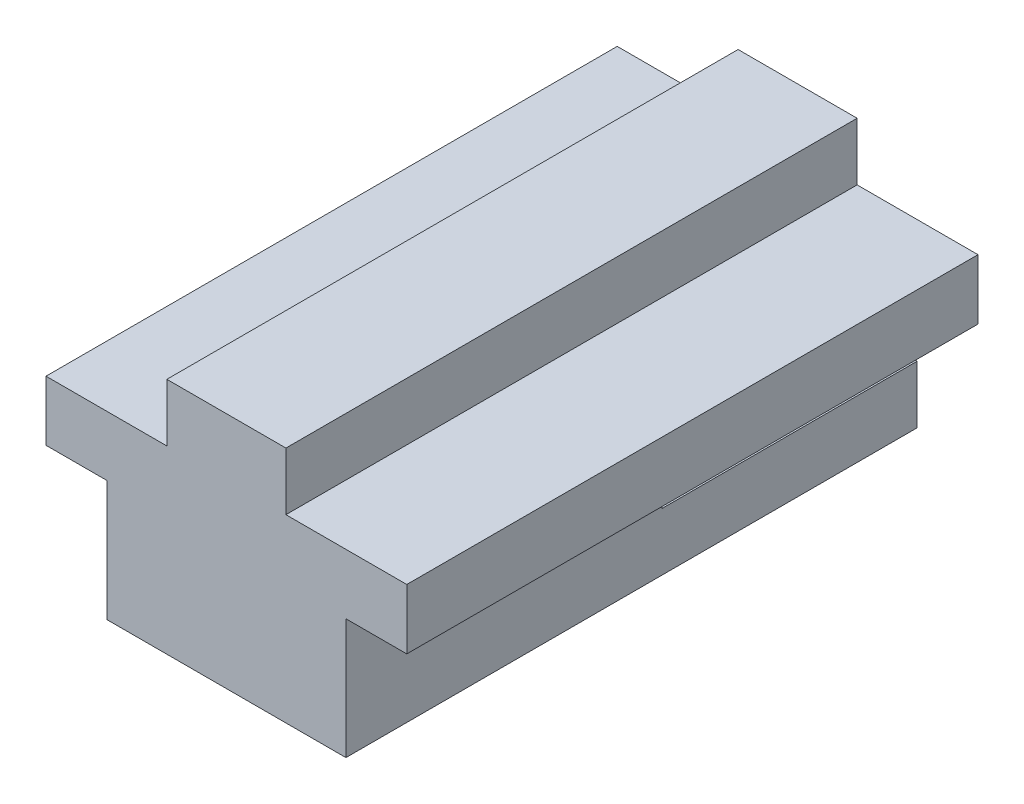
ISO-10303-21;
HEADER;
FILE_DESCRIPTION(('STEP AP214'),'2;1');
FILE_NAME('part.step','',(''),(''),'','','');
FILE_SCHEMA(('AUTOMOTIVE_DESIGN { 1 0 10303 214 1 1 1 1 }'));
ENDSEC;
DATA;
#1=APPLICATION_CONTEXT('core data for automotive mechanical design processes');
#2=APPLICATION_PROTOCOL_DEFINITION('international standard','automotive_design',2000,#1);
#3=PRODUCT_CONTEXT('',#1,'mechanical');
#4=PRODUCT('Part','Part','',(#3));
#5=PRODUCT_RELATED_PRODUCT_CATEGORY('part','',(#4));
#6=PRODUCT_DEFINITION_FORMATION('','',#4);
#7=PRODUCT_DEFINITION_CONTEXT('part definition',#1,'design');
#8=PRODUCT_DEFINITION('design','',#6,#7);
#9=PRODUCT_DEFINITION_SHAPE('','',#8);
#10=(LENGTH_UNIT() NAMED_UNIT(*) SI_UNIT(.MILLI.,.METRE.));
#11=(NAMED_UNIT(*) PLANE_ANGLE_UNIT() SI_UNIT($,.RADIAN.));
#12=(NAMED_UNIT(*) SI_UNIT($,.STERADIAN.) SOLID_ANGLE_UNIT());
#13=UNCERTAINTY_MEASURE_WITH_UNIT(LENGTH_MEASURE(1.E-05),#10,'distance_accuracy_value','');
#14=(GEOMETRIC_REPRESENTATION_CONTEXT(3) GLOBAL_UNCERTAINTY_ASSIGNED_CONTEXT((#13)) GLOBAL_UNIT_ASSIGNED_CONTEXT((#10,
#11,#12)) REPRESENTATION_CONTEXT('',''));
#15=CARTESIAN_POINT('',(0.,0.,0.));
#16=DIRECTION('',(0.,0.,1.));
#17=DIRECTION('',(1.,0.,0.));
#18=AXIS2_PLACEMENT_3D('',#15,#16,#17);
#19=CARTESIAN_POINT('',(0.,0.,-60.325));
#20=DIRECTION('',(0.,0.,-1.));
#21=DIRECTION('',(-1.,0.,0.));
#22=AXIS2_PLACEMENT_3D('',#19,#20,#21);
#23=PLANE('',#22);
#24=DIRECTION('',(1.,0.,0.));
#25=VECTOR('',#24,1.);
#26=CARTESIAN_POINT('',(26.9748,0.,-60.325));
#27=LINE('',#26,#25);
#28=CARTESIAN_POINT('',(1.7272,0.,-60.325));
#29=VERTEX_POINT('',#28);
#30=CARTESIAN_POINT('',(33.401,0.,-60.325));
#31=VERTEX_POINT('',#30);
#32=EDGE_CURVE('E257',#29,#31,#27,.T.);
#33=ORIENTED_EDGE('',*,*,#32,.F.);
#34=DIRECTION('',(0.,-1.,0.));
#35=VECTOR('',#34,1.);
#36=CARTESIAN_POINT('',(1.7272,0.0254000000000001,-60.325));
#37=LINE('',#36,#35);
#38=CARTESIAN_POINT('',(1.7272,0.0254000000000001,-60.325));
#39=VERTEX_POINT('',#38);
#40=EDGE_CURVE('E247',#39,#29,#37,.T.);
#41=ORIENTED_EDGE('',*,*,#40,.F.);
#42=DIRECTION('',(1.,0.,0.));
#43=VECTOR('',#42,1.);
#44=CARTESIAN_POINT('',(-4.699,0.0254000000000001,-60.325));
#45=LINE('',#44,#43);
#46=CARTESIAN_POINT('',(-4.699,0.0254000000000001,-60.325));
#47=VERTEX_POINT('',#46);
#48=EDGE_CURVE('E248',#47,#39,#45,.T.);
#49=ORIENTED_EDGE('',*,*,#48,.F.);
#50=DIRECTION('',(0.,-1.,0.));
#51=VECTOR('',#50,1.);
#52=CARTESIAN_POINT('',(-4.699,0.0254000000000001,-60.325));
#53=LINE('',#52,#51);
#54=CARTESIAN_POINT('',(-4.699,6.35,-60.325));
#55=VERTEX_POINT('',#54);
#56=EDGE_CURVE('E204',#55,#47,#53,.T.);
#57=ORIENTED_EDGE('',*,*,#56,.F.);
#58=DIRECTION('',(-1.,0.,0.));
#59=VECTOR('',#58,1.);
#60=CARTESIAN_POINT('',(-4.699,6.35,-60.325));
#61=LINE('',#60,#59);
#62=CARTESIAN_POINT('',(8.0645,6.35,-60.325));
#63=VERTEX_POINT('',#62);
#64=EDGE_CURVE('E160',#63,#55,#61,.T.);
#65=ORIENTED_EDGE('',*,*,#64,.F.);
#66=DIRECTION('',(0.,-1.,0.));
#67=VECTOR('',#66,1.);
#68=CARTESIAN_POINT('',(8.0645,6.35,-60.325));
#69=LINE('',#68,#67);
#70=CARTESIAN_POINT('',(8.0645,12.446,-60.325));
#71=VERTEX_POINT('',#70);
#72=EDGE_CURVE('E143',#71,#63,#69,.T.);
#73=ORIENTED_EDGE('',*,*,#72,.F.);
#74=DIRECTION('',(-1.,0.,0.));
#75=VECTOR('',#74,1.);
#76=CARTESIAN_POINT('',(8.0645,12.446,-60.325));
#77=LINE('',#76,#75);
#78=CARTESIAN_POINT('',(20.6375,12.446,-60.325));
#79=VERTEX_POINT('',#78);
#80=EDGE_CURVE('E158',#79,#71,#77,.T.);
#81=ORIENTED_EDGE('',*,*,#80,.F.);
#82=DIRECTION('',(0.,1.,0.));
#83=VECTOR('',#82,1.);
#84=CARTESIAN_POINT('',(20.6375,6.35,-60.325));
#85=LINE('',#84,#83);
#86=CARTESIAN_POINT('',(20.6375,6.35,-60.325));
#87=VERTEX_POINT('',#86);
#88=EDGE_CURVE('E163',#87,#79,#85,.T.);
#89=ORIENTED_EDGE('',*,*,#88,.F.);
#90=DIRECTION('',(-1.,0.,0.));
#91=VECTOR('',#90,1.);
#92=CARTESIAN_POINT('',(20.6375,6.35,-60.325));
#93=LINE('',#92,#91);
#94=CARTESIAN_POINT('',(33.401,6.35,-60.325));
#95=VERTEX_POINT('',#94);
#96=EDGE_CURVE('E165',#95,#87,#93,.T.);
#97=ORIENTED_EDGE('',*,*,#96,.F.);
#98=DIRECTION('',(0.,1.,0.));
#99=VECTOR('',#98,1.);
#100=CARTESIAN_POINT('',(33.401,0.,-60.325));
#101=LINE('',#100,#99);
#102=EDGE_CURVE('E260',#31,#95,#101,.T.);
#103=ORIENTED_EDGE('',*,*,#102,.F.);
#104=EDGE_LOOP('',(#33,#41,#49,#57,#65,#73,#81,#89,#97,#103));
#105=FACE_BOUND('',#104,.T.);
#106=ADVANCED_FACE('F37',(#105),#23,.T.);
#107=CARTESIAN_POINT('',(-4.699,0.0254000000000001,-60.325));
#108=DIRECTION('',(-1.,0.,0.));
#109=DIRECTION('',(0.,0.,1.));
#110=AXIS2_PLACEMENT_3D('',#107,#108,#109);
#111=PLANE('',#110);
#112=DIRECTION('',(0.,-1.,0.));
#113=VECTOR('',#112,1.);
#114=CARTESIAN_POINT('',(-4.699,0.0254000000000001,0.));
#115=LINE('',#114,#113);
#116=CARTESIAN_POINT('',(-4.699,6.35,0.));
#117=VERTEX_POINT('',#116);
#118=CARTESIAN_POINT('',(-4.699,0.0254000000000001,0.));
#119=VERTEX_POINT('',#118);
#120=EDGE_CURVE('E170',#117,#119,#115,.T.);
#121=ORIENTED_EDGE('',*,*,#120,.F.);
#122=DIRECTION('',(0.,0.,1.));
#123=VECTOR('',#122,1.);
#124=CARTESIAN_POINT('',(-4.699,6.35,-60.325));
#125=LINE('',#124,#123);
#126=EDGE_CURVE('E61',#55,#117,#125,.T.);
#127=ORIENTED_EDGE('',*,*,#126,.F.);
#128=ORIENTED_EDGE('',*,*,#56,.T.);
#129=DIRECTION('',(0.,0.,1.));
#130=VECTOR('',#129,1.);
#131=CARTESIAN_POINT('',(-4.699,0.0254000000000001,-60.325));
#132=LINE('',#131,#130);
#133=EDGE_CURVE('E112',#47,#119,#132,.T.);
#134=ORIENTED_EDGE('',*,*,#133,.T.);
#135=EDGE_LOOP('',(#121,#127,#128,#134));
#136=FACE_BOUND('',#135,.T.);
#137=ADVANCED_FACE('F39',(#136),#111,.T.);
#138=CARTESIAN_POINT('',(-4.699,6.35,-60.325));
#139=DIRECTION('',(0.,1.,0.));
#140=DIRECTION('',(0.,0.,1.));
#141=AXIS2_PLACEMENT_3D('',#138,#139,#140);
#142=PLANE('',#141);
#143=DIRECTION('',(-1.,0.,0.));
#144=VECTOR('',#143,1.);
#145=CARTESIAN_POINT('',(-4.699,6.35,0.));
#146=LINE('',#145,#144);
#147=CARTESIAN_POINT('',(8.0645,6.35,0.));
#148=VERTEX_POINT('',#147);
#149=EDGE_CURVE('E201',#148,#117,#146,.T.);
#150=ORIENTED_EDGE('',*,*,#149,.F.);
#151=DIRECTION('',(0.,0.,1.));
#152=VECTOR('',#151,1.);
#153=CARTESIAN_POINT('',(8.0645,6.35,-60.325));
#154=LINE('',#153,#152);
#155=EDGE_CURVE('E151',#63,#148,#154,.T.);
#156=ORIENTED_EDGE('',*,*,#155,.F.);
#157=ORIENTED_EDGE('',*,*,#64,.T.);
#158=ORIENTED_EDGE('',*,*,#126,.T.);
#159=EDGE_LOOP('',(#150,#156,#157,#158));
#160=FACE_BOUND('',#159,.T.);
#161=ADVANCED_FACE('F319',(#160),#142,.T.);
#162=CARTESIAN_POINT('',(8.0645,6.35,-60.325));
#163=DIRECTION('',(-1.,0.,0.));
#164=DIRECTION('',(0.,-1.,0.));
#165=AXIS2_PLACEMENT_3D('',#162,#163,#164);
#166=PLANE('',#165);
#167=DIRECTION('',(0.,-1.,0.));
#168=VECTOR('',#167,1.);
#169=CARTESIAN_POINT('',(8.0645,6.35,0.));
#170=LINE('',#169,#168);
#171=CARTESIAN_POINT('',(8.0645,12.446,0.));
#172=VERTEX_POINT('',#171);
#173=EDGE_CURVE('E146',#172,#148,#170,.T.);
#174=ORIENTED_EDGE('',*,*,#173,.F.);
#175=DIRECTION('',(0.,0.,1.));
#176=VECTOR('',#175,1.);
#177=CARTESIAN_POINT('',(8.0645,12.446,-60.325));
#178=LINE('',#177,#176);
#179=EDGE_CURVE('E140',#71,#172,#178,.T.);
#180=ORIENTED_EDGE('',*,*,#179,.F.);
#181=ORIENTED_EDGE('',*,*,#72,.T.);
#182=ORIENTED_EDGE('',*,*,#155,.T.);
#183=EDGE_LOOP('',(#174,#180,#181,#182));
#184=FACE_BOUND('',#183,.T.);
#185=ADVANCED_FACE('F142',(#184),#166,.T.);
#186=CARTESIAN_POINT('',(8.0645,12.446,-60.325));
#187=DIRECTION('',(0.,1.,0.));
#188=DIRECTION('',(0.,0.,1.));
#189=AXIS2_PLACEMENT_3D('',#186,#187,#188);
#190=PLANE('',#189);
#191=DIRECTION('',(-1.,0.,0.));
#192=VECTOR('',#191,1.);
#193=CARTESIAN_POINT('',(8.0645,12.446,0.));
#194=LINE('',#193,#192);
#195=CARTESIAN_POINT('',(20.6375,12.446,0.));
#196=VERTEX_POINT('',#195);
#197=EDGE_CURVE('E198',#196,#172,#194,.T.);
#198=ORIENTED_EDGE('',*,*,#197,.F.);
#199=DIRECTION('',(0.,0.,1.));
#200=VECTOR('',#199,1.);
#201=CARTESIAN_POINT('',(20.6375,12.446,-60.325));
#202=LINE('',#201,#200);
#203=EDGE_CURVE('E152',#79,#196,#202,.T.);
#204=ORIENTED_EDGE('',*,*,#203,.F.);
#205=ORIENTED_EDGE('',*,*,#80,.T.);
#206=ORIENTED_EDGE('',*,*,#179,.T.);
#207=EDGE_LOOP('',(#198,#204,#205,#206));
#208=FACE_BOUND('',#207,.T.);
#209=ADVANCED_FACE('F162',(#208),#190,.T.);
#210=CARTESIAN_POINT('',(20.6375,6.35,-60.325));
#211=DIRECTION('',(1.,0.,0.));
#212=DIRECTION('',(0.,0.,-1.));
#213=AXIS2_PLACEMENT_3D('',#210,#211,#212);
#214=PLANE('',#213);
#215=DIRECTION('',(0.,1.,0.));
#216=VECTOR('',#215,1.);
#217=CARTESIAN_POINT('',(20.6375,6.35,0.));
#218=LINE('',#217,#216);
#219=CARTESIAN_POINT('',(20.6375,6.35,0.));
#220=VERTEX_POINT('',#219);
#221=EDGE_CURVE('E195',#220,#196,#218,.T.);
#222=ORIENTED_EDGE('',*,*,#221,.F.);
#223=DIRECTION('',(0.,0.,1.));
#224=VECTOR('',#223,1.);
#225=CARTESIAN_POINT('',(20.6375,6.35,-60.325));
#226=LINE('',#225,#224);
#227=EDGE_CURVE('E208',#87,#220,#226,.T.);
#228=ORIENTED_EDGE('',*,*,#227,.F.);
#229=ORIENTED_EDGE('',*,*,#88,.T.);
#230=ORIENTED_EDGE('',*,*,#203,.T.);
#231=EDGE_LOOP('',(#222,#228,#229,#230));
#232=FACE_BOUND('',#231,.T.);
#233=ADVANCED_FACE('F323',(#232),#214,.T.);
#234=CARTESIAN_POINT('',(20.6375,6.35,-60.325));
#235=DIRECTION('',(0.,1.,0.));
#236=DIRECTION('',(0.,0.,1.));
#237=AXIS2_PLACEMENT_3D('',#234,#235,#236);
#238=PLANE('',#237);
#239=DIRECTION('',(-1.,0.,0.));
#240=VECTOR('',#239,1.);
#241=CARTESIAN_POINT('',(20.6375,6.35,0.));
#242=LINE('',#241,#240);
#243=CARTESIAN_POINT('',(33.401,6.35,0.));
#244=VERTEX_POINT('',#243);
#245=EDGE_CURVE('E192',#244,#220,#242,.T.);
#246=ORIENTED_EDGE('',*,*,#245,.F.);
#247=DIRECTION('',(0.,0.,1.));
#248=VECTOR('',#247,1.);
#249=CARTESIAN_POINT('',(33.401,6.35,-60.325));
#250=LINE('',#249,#248);
#251=EDGE_CURVE('E210',#95,#244,#250,.T.);
#252=ORIENTED_EDGE('',*,*,#251,.F.);
#253=ORIENTED_EDGE('',*,*,#96,.T.);
#254=ORIENTED_EDGE('',*,*,#227,.T.);
#255=EDGE_LOOP('',(#246,#252,#253,#254));
#256=FACE_BOUND('',#255,.T.);
#257=ADVANCED_FACE('F266',(#256),#238,.T.);
#258=CARTESIAN_POINT('',(33.401,0.,-60.325));
#259=DIRECTION('',(1.,0.,0.));
#260=DIRECTION('',(0.,0.,-1.));
#261=AXIS2_PLACEMENT_3D('',#258,#259,#260);
#262=PLANE('',#261);
#263=DIRECTION('',(0.,1.,0.));
#264=VECTOR('',#263,1.);
#265=CARTESIAN_POINT('',(33.401,0.,0.));
#266=LINE('',#265,#264);
#267=CARTESIAN_POINT('',(33.401,0.,0.));
#268=VERTEX_POINT('',#267);
#269=EDGE_CURVE('E189',#268,#244,#266,.T.);
#270=ORIENTED_EDGE('',*,*,#269,.F.);
#271=DIRECTION('',(0.,0.,1.));
#272=VECTOR('',#271,1.);
#273=CARTESIAN_POINT('',(33.401,0.,-60.325));
#274=LINE('',#273,#272);
#275=EDGE_CURVE('E212',#31,#268,#274,.T.);
#276=ORIENTED_EDGE('',*,*,#275,.F.);
#277=ORIENTED_EDGE('',*,*,#102,.T.);
#278=ORIENTED_EDGE('',*,*,#251,.T.);
#279=EDGE_LOOP('',(#270,#276,#277,#278));
#280=FACE_BOUND('',#279,.T.);
#281=ADVANCED_FACE('F271',(#280),#262,.T.);
#282=CARTESIAN_POINT('',(26.9748,0.,-60.325));
#283=DIRECTION('',(0.,-1.,0.));
#284=DIRECTION('',(1.,0.,0.));
#285=AXIS2_PLACEMENT_3D('',#282,#283,#284);
#286=PLANE('',#285);
#287=DIRECTION('',(0.,0.,1.));
#288=VECTOR('',#287,1.);
#289=CARTESIAN_POINT('',(26.9748,0.,-60.325));
#290=LINE('',#289,#288);
#291=CARTESIAN_POINT('',(26.9748,0.,-33.401));
#292=VERTEX_POINT('',#291);
#293=CARTESIAN_POINT('',(26.9748,0.,0.));
#294=VERTEX_POINT('',#293);
#295=EDGE_CURVE('E214',#292,#294,#290,.T.);
#296=ORIENTED_EDGE('',*,*,#295,.F.);
#297=DIRECTION('',(-1.,0.,0.));
#298=VECTOR('',#297,1.);
#299=CARTESIAN_POINT('',(33.401,0.,-33.401));
#300=LINE('',#299,#298);
#301=CARTESIAN_POINT('',(1.7272,0.,-33.401));
#302=VERTEX_POINT('',#301);
#303=EDGE_CURVE('E241',#292,#302,#300,.T.);
#304=ORIENTED_EDGE('',*,*,#303,.T.);
#305=DIRECTION('',(0.,0.,-1.));
#306=VECTOR('',#305,1.);
#307=CARTESIAN_POINT('',(1.7272,0.,-60.325));
#308=LINE('',#307,#306);
#309=EDGE_CURVE('E278',#302,#29,#308,.T.);
#310=ORIENTED_EDGE('',*,*,#309,.T.);
#311=ORIENTED_EDGE('',*,*,#32,.T.);
#312=ORIENTED_EDGE('',*,*,#275,.T.);
#313=DIRECTION('',(1.,0.,0.));
#314=VECTOR('',#313,1.);
#315=CARTESIAN_POINT('',(26.9748,0.,0.));
#316=LINE('',#315,#314);
#317=EDGE_CURVE('E186',#294,#268,#316,.T.);
#318=ORIENTED_EDGE('',*,*,#317,.F.);
#319=EDGE_LOOP('',(#296,#304,#310,#311,#312,#318));
#320=FACE_BOUND('',#319,.T.);
#321=ADVANCED_FACE('F275',(#320),#286,.T.);
#322=CARTESIAN_POINT('',(26.9748,0.,-60.325));
#323=DIRECTION('',(1.,0.,0.));
#324=DIRECTION('',(0.,0.,-1.));
#325=AXIS2_PLACEMENT_3D('',#322,#323,#324);
#326=PLANE('',#325);
#327=DIRECTION('',(0.,-1.,0.));
#328=VECTOR('',#327,1.);
#329=CARTESIAN_POINT('',(26.9748,0.,-33.401));
#330=LINE('',#329,#328);
#331=CARTESIAN_POINT('',(26.9748,-6.604,-33.401));
#332=VERTEX_POINT('',#331);
#333=EDGE_CURVE('E452',#292,#332,#330,.T.);
#334=ORIENTED_EDGE('',*,*,#333,.F.);
#335=ORIENTED_EDGE('',*,*,#295,.T.);
#336=DIRECTION('',(0.,1.,0.));
#337=VECTOR('',#336,1.);
#338=CARTESIAN_POINT('',(26.9748,0.,0.));
#339=LINE('',#338,#337);
#340=CARTESIAN_POINT('',(26.9748,-12.7,0.));
#341=VERTEX_POINT('',#340);
#342=EDGE_CURVE('E183',#341,#294,#339,.T.);
#343=ORIENTED_EDGE('',*,*,#342,.F.);
#344=DIRECTION('',(0.,0.,1.));
#345=VECTOR('',#344,1.);
#346=CARTESIAN_POINT('',(26.9748,-12.7,-60.325));
#347=LINE('',#346,#345);
#348=CARTESIAN_POINT('',(26.9748,-12.7,-60.325));
#349=VERTEX_POINT('',#348);
#350=EDGE_CURVE('E216',#349,#341,#347,.T.);
#351=ORIENTED_EDGE('',*,*,#350,.F.);
#352=DIRECTION('',(0.,1.,0.));
#353=VECTOR('',#352,1.);
#354=CARTESIAN_POINT('',(26.9748,0.,-60.325));
#355=LINE('',#354,#353);
#356=CARTESIAN_POINT('',(26.9748,-6.604,-60.325));
#357=VERTEX_POINT('',#356);
#358=EDGE_CURVE('E255',#349,#357,#355,.T.);
#359=ORIENTED_EDGE('',*,*,#358,.T.);
#360=DIRECTION('',(0.,0.,-1.));
#361=VECTOR('',#360,1.);
#362=CARTESIAN_POINT('',(26.9748,-6.604,-60.325));
#363=LINE('',#362,#361);
#364=EDGE_CURVE('E52',#332,#357,#363,.T.);
#365=ORIENTED_EDGE('',*,*,#364,.F.);
#366=EDGE_LOOP('',(#334,#335,#343,#351,#359,#365));
#367=FACE_BOUND('',#366,.T.);
#368=ADVANCED_FACE('F354',(#367),#326,.T.);
#369=CARTESIAN_POINT('',(1.7272,-12.7,-60.325));
#370=DIRECTION('',(0.,-1.,0.));
#371=DIRECTION('',(0.,0.,-1.));
#372=AXIS2_PLACEMENT_3D('',#369,#370,#371);
#373=PLANE('',#372);
#374=CARTESIAN_POINT('',(14.351,-12.7,-4.7625));
#375=DIRECTION('',(0.,-1.,0.));
#376=DIRECTION('',(0.,0.,-1.));
#377=AXIS2_PLACEMENT_3D('',#374,#375,#376);
#378=CIRCLE('',#377,3.048);
#379=CARTESIAN_POINT('',(14.351,-12.7,-7.8105));
#380=VERTEX_POINT('',#379);
#381=EDGE_CURVE('E455',#380,#380,#378,.T.);
#382=ORIENTED_EDGE('',*,*,#381,.F.);
#383=EDGE_LOOP('',(#382));
#384=FACE_BOUND('',#383,.T.);
#385=CARTESIAN_POINT('',(14.351,-12.7,-26.9875));
#386=DIRECTION('',(0.,-1.,0.));
#387=DIRECTION('',(0.,0.,-1.));
#388=AXIS2_PLACEMENT_3D('',#385,#386,#387);
#389=CIRCLE('',#388,3.048);
#390=CARTESIAN_POINT('',(14.351,-12.7,-30.0355));
#391=VERTEX_POINT('',#390);
#392=EDGE_CURVE('E309',#391,#391,#389,.T.);
#393=ORIENTED_EDGE('',*,*,#392,.F.);
#394=EDGE_LOOP('',(#393));
#395=FACE_BOUND('',#394,.T.);
#396=CARTESIAN_POINT('',(20.701,-12.7,-15.875));
#397=DIRECTION('',(0.,-1.,0.));
#398=DIRECTION('',(1.,0.,0.));
#399=AXIS2_PLACEMENT_3D('',#396,#397,#398);
#400=CIRCLE('',#399,2.3876);
#401=CARTESIAN_POINT('',(23.0886,-12.7,-15.875));
#402=VERTEX_POINT('',#401);
#403=EDGE_CURVE('E302',#402,#402,#400,.T.);
#404=ORIENTED_EDGE('',*,*,#403,.F.);
#405=EDGE_LOOP('',(#404));
#406=FACE_BOUND('',#405,.T.);
#407=CARTESIAN_POINT('',(8.001,-12.7,-15.875));
#408=DIRECTION('',(0.,-1.,0.));
#409=DIRECTION('',(1.,0.,0.));
#410=AXIS2_PLACEMENT_3D('',#407,#408,#409);
#411=CIRCLE('',#410,2.3876);
#412=CARTESIAN_POINT('',(10.3886,-12.7,-15.875));
#413=VERTEX_POINT('',#412);
#414=EDGE_CURVE('E314',#413,#413,#411,.T.);
#415=ORIENTED_EDGE('',*,*,#414,.F.);
#416=EDGE_LOOP('',(#415));
#417=FACE_BOUND('',#416,.T.);
#418=DIRECTION('',(1.,0.,0.));
#419=VECTOR('',#418,1.);
#420=CARTESIAN_POINT('',(1.7272,-12.7,0.));
#421=LINE('',#420,#419);
#422=CARTESIAN_POINT('',(1.7272,-12.7,0.));
#423=VERTEX_POINT('',#422);
#424=EDGE_CURVE('E180',#423,#341,#421,.T.);
#425=ORIENTED_EDGE('',*,*,#424,.F.);
#426=DIRECTION('',(0.,0.,1.));
#427=VECTOR('',#426,1.);
#428=CARTESIAN_POINT('',(1.7272,-12.7,-60.325));
#429=LINE('',#428,#427);
#430=CARTESIAN_POINT('',(1.7272,-12.7,-60.325));
#431=VERTEX_POINT('',#430);
#432=EDGE_CURVE('E218',#431,#423,#429,.T.);
#433=ORIENTED_EDGE('',*,*,#432,.F.);
#434=DIRECTION('',(1.,0.,0.));
#435=VECTOR('',#434,1.);
#436=CARTESIAN_POINT('',(1.7272,-12.7,-60.325));
#437=LINE('',#436,#435);
#438=EDGE_CURVE('E246',#431,#349,#437,.T.);
#439=ORIENTED_EDGE('',*,*,#438,.T.);
#440=ORIENTED_EDGE('',*,*,#350,.T.);
#441=EDGE_LOOP('',(#425,#433,#439,#440));
#442=FACE_BOUND('',#441,.T.);
#443=ADVANCED_FACE('F349',(#384,#395,#406,#417,#442),#373,.T.);
#444=CARTESIAN_POINT('',(1.7272,0.0254000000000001,-60.325));
#445=DIRECTION('',(-1.,0.,0.));
#446=DIRECTION('',(0.,-1.,0.));
#447=AXIS2_PLACEMENT_3D('',#444,#445,#446);
#448=PLANE('',#447);
#449=ORIENTED_EDGE('',*,*,#309,.F.);
#450=DIRECTION('',(0.,1.,0.));
#451=VECTOR('',#450,1.);
#452=CARTESIAN_POINT('',(1.7272,0.0254000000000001,-33.401));
#453=LINE('',#452,#451);
#454=CARTESIAN_POINT('',(1.7272,-6.604,-33.401));
#455=VERTEX_POINT('',#454);
#456=EDGE_CURVE('E11',#455,#302,#453,.T.);
#457=ORIENTED_EDGE('',*,*,#456,.F.);
#458=DIRECTION('',(0.,0.,1.));
#459=VECTOR('',#458,1.);
#460=CARTESIAN_POINT('',(1.7272,-6.604,-60.325));
#461=LINE('',#460,#459);
#462=CARTESIAN_POINT('',(1.7272,-6.604,-60.325));
#463=VERTEX_POINT('',#462);
#464=EDGE_CURVE('E227',#463,#455,#461,.T.);
#465=ORIENTED_EDGE('',*,*,#464,.F.);
#466=EDGE_CURVE('E239',#463,#431,#37,.T.);
#467=ORIENTED_EDGE('',*,*,#466,.T.);
#468=ORIENTED_EDGE('',*,*,#432,.T.);
#469=DIRECTION('',(0.,-1.,0.));
#470=VECTOR('',#469,1.);
#471=CARTESIAN_POINT('',(1.7272,0.0254000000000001,0.));
#472=LINE('',#471,#470);
#473=CARTESIAN_POINT('',(1.7272,0.0254000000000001,0.));
#474=VERTEX_POINT('',#473);
#475=EDGE_CURVE('E177',#474,#423,#472,.T.);
#476=ORIENTED_EDGE('',*,*,#475,.F.);
#477=DIRECTION('',(0.,0.,1.));
#478=VECTOR('',#477,1.);
#479=CARTESIAN_POINT('',(1.7272,0.0254000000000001,-60.325));
#480=LINE('',#479,#478);
#481=EDGE_CURVE('E220',#39,#474,#480,.T.);
#482=ORIENTED_EDGE('',*,*,#481,.F.);
#483=ORIENTED_EDGE('',*,*,#40,.T.);
#484=EDGE_LOOP('',(#449,#457,#465,#467,#468,#476,#482,#483));
#485=FACE_BOUND('',#484,.T.);
#486=ADVANCED_FACE('F238',(#485),#448,.T.);
#487=CARTESIAN_POINT('',(-4.699,0.0254000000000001,-60.325));
#488=DIRECTION('',(0.,-1.,0.));
#489=DIRECTION('',(0.,0.,-1.));
#490=AXIS2_PLACEMENT_3D('',#487,#488,#489);
#491=PLANE('',#490);
#492=DIRECTION('',(1.,0.,0.));
#493=VECTOR('',#492,1.);
#494=CARTESIAN_POINT('',(-4.699,0.0254000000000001,0.));
#495=LINE('',#494,#493);
#496=EDGE_CURVE('E173',#119,#474,#495,.T.);
#497=ORIENTED_EDGE('',*,*,#496,.F.);
#498=ORIENTED_EDGE('',*,*,#133,.F.);
#499=ORIENTED_EDGE('',*,*,#48,.T.);
#500=ORIENTED_EDGE('',*,*,#481,.T.);
#501=EDGE_LOOP('',(#497,#498,#499,#500));
#502=FACE_BOUND('',#501,.T.);
#503=ADVANCED_FACE('F340',(#502),#491,.T.);
#504=DIRECTION('',(-1.,0.,0.));
#505=VECTOR('',#504,1.);
#506=CARTESIAN_POINT('',(0.,-6.604,-60.325));
#507=LINE('',#506,#505);
#508=EDGE_CURVE('E45',#357,#463,#507,.T.);
#509=ORIENTED_EDGE('',*,*,#508,.F.);
#510=ORIENTED_EDGE('',*,*,#358,.F.);
#511=ORIENTED_EDGE('',*,*,#438,.F.);
#512=ORIENTED_EDGE('',*,*,#466,.F.);
#513=EDGE_LOOP('',(#509,#510,#511,#512));
#514=FACE_BOUND('',#513,.T.);
#515=ADVANCED_FACE('F244',(#514),#23,.T.);
#516=CARTESIAN_POINT('',(0.,0.,0.));
#517=DIRECTION('',(0.,0.,-1.));
#518=DIRECTION('',(-1.,0.,0.));
#519=AXIS2_PLACEMENT_3D('',#516,#517,#518);
#520=PLANE('',#519);
#521=ORIENTED_EDGE('',*,*,#120,.T.);
#522=ORIENTED_EDGE('',*,*,#496,.T.);
#523=ORIENTED_EDGE('',*,*,#475,.T.);
#524=ORIENTED_EDGE('',*,*,#424,.T.);
#525=ORIENTED_EDGE('',*,*,#342,.T.);
#526=ORIENTED_EDGE('',*,*,#317,.T.);
#527=ORIENTED_EDGE('',*,*,#269,.T.);
#528=ORIENTED_EDGE('',*,*,#245,.T.);
#529=ORIENTED_EDGE('',*,*,#221,.T.);
#530=ORIENTED_EDGE('',*,*,#197,.T.);
#531=ORIENTED_EDGE('',*,*,#173,.T.);
#532=ORIENTED_EDGE('',*,*,#149,.T.);
#533=EDGE_LOOP('',(#521,#522,#523,#524,#525,#526,#527,#528,#529,#530,#531,#532));
#534=FACE_BOUND('',#533,.T.);
#535=ADVANCED_FACE('F321',(#534),#520,.F.);
#536=CARTESIAN_POINT('',(8.001,-6.35,-15.875));
#537=DIRECTION('',(0.,-1.,0.));
#538=DIRECTION('',(1.,0.,0.));
#539=AXIS2_PLACEMENT_3D('',#536,#537,#538);
#540=CYLINDRICAL_SURFACE('',#539,2.3876);
#541=CARTESIAN_POINT('',(8.001,-6.35,-15.875));
#542=DIRECTION('',(0.,-1.,0.));
#543=DIRECTION('',(1.,0.,0.));
#544=AXIS2_PLACEMENT_3D('',#541,#542,#543);
#545=CIRCLE('',#544,2.3876);
#546=CARTESIAN_POINT('',(10.3886,-6.35,-15.875));
#547=VERTEX_POINT('',#546);
#548=EDGE_CURVE('E174',#547,#547,#545,.T.);
#549=ORIENTED_EDGE('',*,*,#548,.F.);
#550=EDGE_LOOP('',(#549));
#551=FACE_BOUND('',#550,.T.);
#552=ORIENTED_EDGE('',*,*,#414,.T.);
#553=EDGE_LOOP('',(#552));
#554=FACE_BOUND('',#553,.T.);
#555=ADVANCED_FACE('F345',(#551,#554),#540,.F.);
#556=CARTESIAN_POINT('',(8.001,-6.35,-15.875));
#557=DIRECTION('',(0.,-1.,0.));
#558=DIRECTION('',(1.,0.,0.));
#559=AXIS2_PLACEMENT_3D('',#556,#557,#558);
#560=PLANE('',#559);
#561=ORIENTED_EDGE('',*,*,#548,.T.);
#562=EDGE_LOOP('',(#561));
#563=FACE_BOUND('',#562,.T.);
#564=ADVANCED_FACE('F436',(#563),#560,.T.);
#565=CARTESIAN_POINT('',(20.701,-6.34999999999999,-15.875));
#566=DIRECTION('',(0.,-1.,0.));
#567=DIRECTION('',(1.,0.,0.));
#568=AXIS2_PLACEMENT_3D('',#565,#566,#567);
#569=CYLINDRICAL_SURFACE('',#568,2.3876);
#570=CARTESIAN_POINT('',(20.701,-6.34999999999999,-15.875));
#571=DIRECTION('',(0.,-1.,0.));
#572=DIRECTION('',(1.,0.,0.));
#573=AXIS2_PLACEMENT_3D('',#570,#571,#572);
#574=CIRCLE('',#573,2.3876);
#575=CARTESIAN_POINT('',(23.0886,-6.34999999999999,-15.875));
#576=VERTEX_POINT('',#575);
#577=EDGE_CURVE('E306',#576,#576,#574,.T.);
#578=ORIENTED_EDGE('',*,*,#577,.F.);
#579=EDGE_LOOP('',(#578));
#580=FACE_BOUND('',#579,.T.);
#581=ORIENTED_EDGE('',*,*,#403,.T.);
#582=EDGE_LOOP('',(#581));
#583=FACE_BOUND('',#582,.T.);
#584=ADVANCED_FACE('F432',(#580,#583),#569,.F.);
#585=CARTESIAN_POINT('',(20.701,-6.34999999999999,-15.875));
#586=DIRECTION('',(0.,-1.,0.));
#587=DIRECTION('',(1.,0.,0.));
#588=AXIS2_PLACEMENT_3D('',#585,#586,#587);
#589=PLANE('',#588);
#590=ORIENTED_EDGE('',*,*,#577,.T.);
#591=EDGE_LOOP('',(#590));
#592=FACE_BOUND('',#591,.T.);
#593=ADVANCED_FACE('F296',(#592),#589,.T.);
#594=CARTESIAN_POINT('',(14.351,-0.761999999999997,-26.9875));
#595=DIRECTION('',(0.,-1.,0.));
#596=DIRECTION('',(0.,0.,-1.));
#597=AXIS2_PLACEMENT_3D('',#594,#595,#596);
#598=CONICAL_SURFACE('',#597,2.0193,1.02974425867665);
#599=CARTESIAN_POINT('',(14.351,0.451317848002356,-26.9875));
#600=VERTEX_POINT('',#599);
#601=VERTEX_LOOP('',#600);
#602=FACE_BOUND('',#601,.T.);
#603=CARTESIAN_POINT('',(14.351,-0.761999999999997,-26.9875));
#604=DIRECTION('',(0.,-1.,0.));
#605=DIRECTION('',(0.,0.,-1.));
#606=AXIS2_PLACEMENT_3D('',#603,#604,#605);
#607=CIRCLE('',#606,2.0193);
#608=CARTESIAN_POINT('',(14.351,-0.761999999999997,-29.0068));
#609=VERTEX_POINT('',#608);
#610=EDGE_CURVE('E300',#609,#609,#607,.T.);
#611=ORIENTED_EDGE('',*,*,#610,.T.);
#612=EDGE_LOOP('',(#611));
#613=FACE_BOUND('',#612,.T.);
#614=ADVANCED_FACE('F292',(#602,#613),#598,.F.);
#615=CARTESIAN_POINT('',(14.351,-12.7,-26.9875));
#616=DIRECTION('',(0.,-1.,0.));
#617=DIRECTION('',(0.,0.,-1.));
#618=AXIS2_PLACEMENT_3D('',#615,#616,#617);
#619=CYLINDRICAL_SURFACE('',#618,2.0193);
#620=ORIENTED_EDGE('',*,*,#610,.F.);
#621=EDGE_LOOP('',(#620));
#622=FACE_BOUND('',#621,.T.);
#623=CARTESIAN_POINT('',(14.351,-11.6713,-26.9875));
#624=DIRECTION('',(0.,-1.,0.));
#625=DIRECTION('',(0.,0.,-1.));
#626=AXIS2_PLACEMENT_3D('',#623,#624,#625);
#627=CIRCLE('',#626,2.0193);
#628=CARTESIAN_POINT('',(14.351,-11.6713,-29.0068));
#629=VERTEX_POINT('',#628);
#630=EDGE_CURVE('E303',#629,#629,#627,.T.);
#631=ORIENTED_EDGE('',*,*,#630,.T.);
#632=EDGE_LOOP('',(#631));
#633=FACE_BOUND('',#632,.T.);
#634=ADVANCED_FACE('F295',(#622,#633),#619,.F.);
#635=CARTESIAN_POINT('',(14.351,-12.7,-26.9875));
#636=DIRECTION('',(0.,-1.,0.));
#637=DIRECTION('',(0.,0.,-1.));
#638=AXIS2_PLACEMENT_3D('',#635,#636,#637);
#639=CONICAL_SURFACE('',#638,3.048,0.785398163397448);
#640=ORIENTED_EDGE('',*,*,#630,.F.);
#641=EDGE_LOOP('',(#640));
#642=FACE_BOUND('',#641,.T.);
#643=ORIENTED_EDGE('',*,*,#392,.T.);
#644=EDGE_LOOP('',(#643));
#645=FACE_BOUND('',#644,.T.);
#646=ADVANCED_FACE('F424',(#642,#645),#639,.F.);
#647=CARTESIAN_POINT('',(14.351,-0.761999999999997,-4.7625));
#648=DIRECTION('',(0.,-1.,0.));
#649=DIRECTION('',(0.,0.,-1.));
#650=AXIS2_PLACEMENT_3D('',#647,#648,#649);
#651=CONICAL_SURFACE('',#650,2.0193,1.02974425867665);
#652=CARTESIAN_POINT('',(14.351,0.451317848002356,-4.7625));
#653=VERTEX_POINT('',#652);
#654=VERTEX_LOOP('',#653);
#655=FACE_BOUND('',#654,.T.);
#656=CARTESIAN_POINT('',(14.351,-0.761999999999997,-4.7625));
#657=DIRECTION('',(0.,-1.,0.));
#658=DIRECTION('',(0.,0.,-1.));
#659=AXIS2_PLACEMENT_3D('',#656,#657,#658);
#660=CIRCLE('',#659,2.0193);
#661=CARTESIAN_POINT('',(14.351,-0.761999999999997,-6.7818));
#662=VERTEX_POINT('',#661);
#663=EDGE_CURVE('E464',#662,#662,#660,.T.);
#664=ORIENTED_EDGE('',*,*,#663,.T.);
#665=EDGE_LOOP('',(#664));
#666=FACE_BOUND('',#665,.T.);
#667=ADVANCED_FACE('F420',(#655,#666),#651,.F.);
#668=CARTESIAN_POINT('',(14.351,-12.7,-4.7625));
#669=DIRECTION('',(0.,-1.,0.));
#670=DIRECTION('',(0.,0.,-1.));
#671=AXIS2_PLACEMENT_3D('',#668,#669,#670);
#672=CYLINDRICAL_SURFACE('',#671,2.0193);
#673=ORIENTED_EDGE('',*,*,#663,.F.);
#674=EDGE_LOOP('',(#673));
#675=FACE_BOUND('',#674,.T.);
#676=CARTESIAN_POINT('',(14.351,-11.6713,-4.7625));
#677=DIRECTION('',(0.,-1.,0.));
#678=DIRECTION('',(0.,0.,-1.));
#679=AXIS2_PLACEMENT_3D('',#676,#677,#678);
#680=CIRCLE('',#679,2.0193);
#681=CARTESIAN_POINT('',(14.351,-11.6713,-6.7818));
#682=VERTEX_POINT('',#681);
#683=EDGE_CURVE('E461',#682,#682,#680,.T.);
#684=ORIENTED_EDGE('',*,*,#683,.T.);
#685=EDGE_LOOP('',(#684));
#686=FACE_BOUND('',#685,.T.);
#687=ADVANCED_FACE('F416',(#675,#686),#672,.F.);
#688=CARTESIAN_POINT('',(14.351,-12.7,-4.7625));
#689=DIRECTION('',(0.,-1.,0.));
#690=DIRECTION('',(0.,0.,-1.));
#691=AXIS2_PLACEMENT_3D('',#688,#689,#690);
#692=CONICAL_SURFACE('',#691,3.048,0.785398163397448);
#693=ORIENTED_EDGE('',*,*,#683,.F.);
#694=EDGE_LOOP('',(#693));
#695=FACE_BOUND('',#694,.T.);
#696=ORIENTED_EDGE('',*,*,#381,.T.);
#697=EDGE_LOOP('',(#696));
#698=FACE_BOUND('',#697,.T.);
#699=ADVANCED_FACE('F400',(#695,#698),#692,.F.);
#700=CARTESIAN_POINT('',(33.401,0.,-33.401));
#701=DIRECTION('',(0.,0.,1.));
#702=DIRECTION('',(1.,0.,0.));
#703=AXIS2_PLACEMENT_3D('',#700,#701,#702);
#704=PLANE('',#703);
#705=ORIENTED_EDGE('',*,*,#333,.T.);
#706=DIRECTION('',(-1.,0.,0.));
#707=VECTOR('',#706,1.);
#708=CARTESIAN_POINT('',(33.401,-6.604,-33.401));
#709=LINE('',#708,#707);
#710=EDGE_CURVE('E480',#332,#455,#709,.T.);
#711=ORIENTED_EDGE('',*,*,#710,.T.);
#712=ORIENTED_EDGE('',*,*,#456,.T.);
#713=ORIENTED_EDGE('',*,*,#303,.F.);
#714=EDGE_LOOP('',(#705,#711,#712,#713));
#715=FACE_BOUND('',#714,.T.);
#716=ADVANCED_FACE('F395',(#715),#704,.F.);
#717=CARTESIAN_POINT('',(33.401,-6.604,-60.325));
#718=DIRECTION('',(0.,-1.,0.));
#719=DIRECTION('',(1.,0.,0.));
#720=AXIS2_PLACEMENT_3D('',#717,#718,#719);
#721=PLANE('',#720);
#722=ORIENTED_EDGE('',*,*,#364,.T.);
#723=ORIENTED_EDGE('',*,*,#508,.T.);
#724=ORIENTED_EDGE('',*,*,#464,.T.);
#725=ORIENTED_EDGE('',*,*,#710,.F.);
#726=EDGE_LOOP('',(#722,#723,#724,#725));
#727=FACE_BOUND('',#726,.T.);
#728=ADVANCED_FACE('F225',(#727),#721,.F.);
#729=CLOSED_SHELL('',(#106,#137,#161,#185,#209,#233,#257,#281,#321,#368,#443,#486,#503,#515,
#535,#555,#564,#584,#593,#614,#634,#646,#667,#687,#699,#716,#728));
#730=MANIFOLD_SOLID_BREP('B2',#729);
#731=ADVANCED_BREP_SHAPE_REPRESENTATION('',(#18,#730),#14);
#732=SHAPE_DEFINITION_REPRESENTATION(#9,#731);
ENDSEC;
END-ISO-10303-21;
